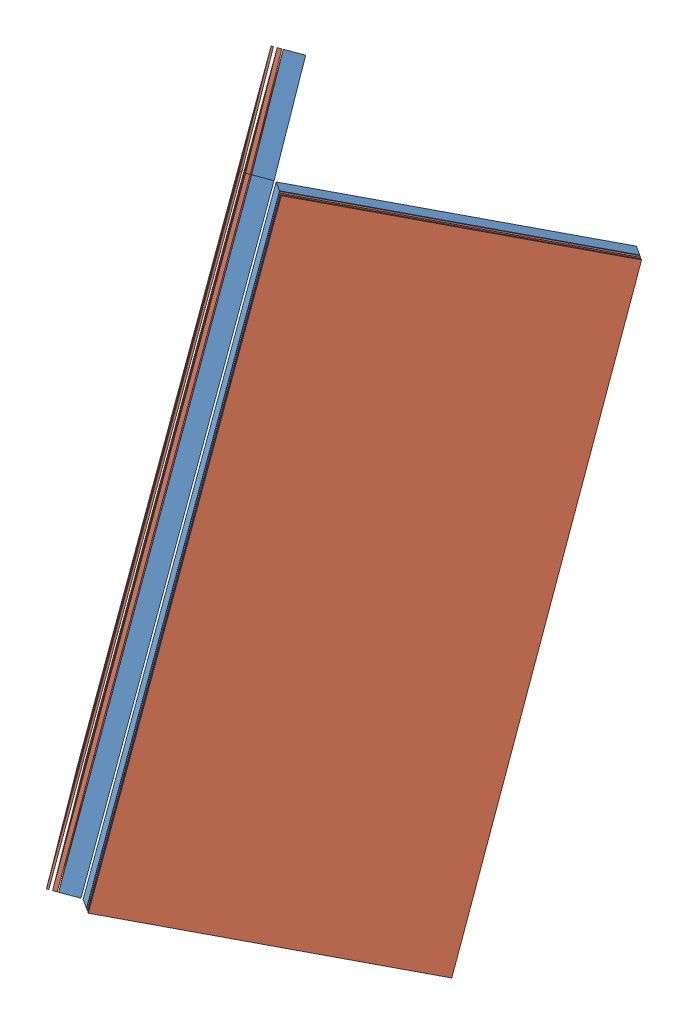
SolidWorks assembly Assem2.SLDASM, configuration Standard (file format 4400). Lengths in mm.
Overall size (12581.97 4462.47 4225.26).
6 component instances, 2 part files, 7 mates.
Components (placement in the parent):
- Assem1-1: Assem1.SLDASM [Standard] at (-68.4105 32.3819 59.1341) x (0.618822 0.269141 0.737986) z (-0.738613 -0.120461 0.66328) size (3717.49 4041.67 1471.05)
  - Steelframe-1: Steelframe.SLDPRT [Standard] at origin size (1557 3086.49 1200.83)
  - Glass-1: Glass.sldprt [Default] at origin size (1557 3069.73 1154.79)
- Assem1-2: Assem1.SLDASM [Standard] at (1056.7219 451.4351 1208.1777) x (0.618822 -0.269141 -0.737986) z (0.738613 -0.120461 0.66328) size (3717.49 4041.67 1471.05)
  - Steelframe-1: Steelframe.SLDPRT [Standard] at origin size (1557 3086.49 1200.83)
  - Glass-1: Glass.sldprt [Default] at origin size (1557 3069.73 1154.79)
Mates (geometry in assembly coordinates):
- Coincident3: coincident: unknown of ?
- Coincident6: coincident: unknown of ?
- Coincident11: coincident: point of ?; point of ?
- Coincident13: coincident: point of ?; point of ?
- LimitAngle2: limit planar angle = 1.807106 rad aligned: plane of ? through (-109.2581 43.49 89.3349) normal (-0.78553 0.213616 0.580784); plane of ? through (1097.5695 462.5431 1238.3785) normal (0.78553 0.213616 0.580784)
- Deckungsgleich2: coincident: unknown of ?
- Deckungsgleich3: coincident = 2151.6059 mm: line of ? through (8.7168 3072.784 -1118.4019) axis (-0.002666 -0.939689 0.342019)
